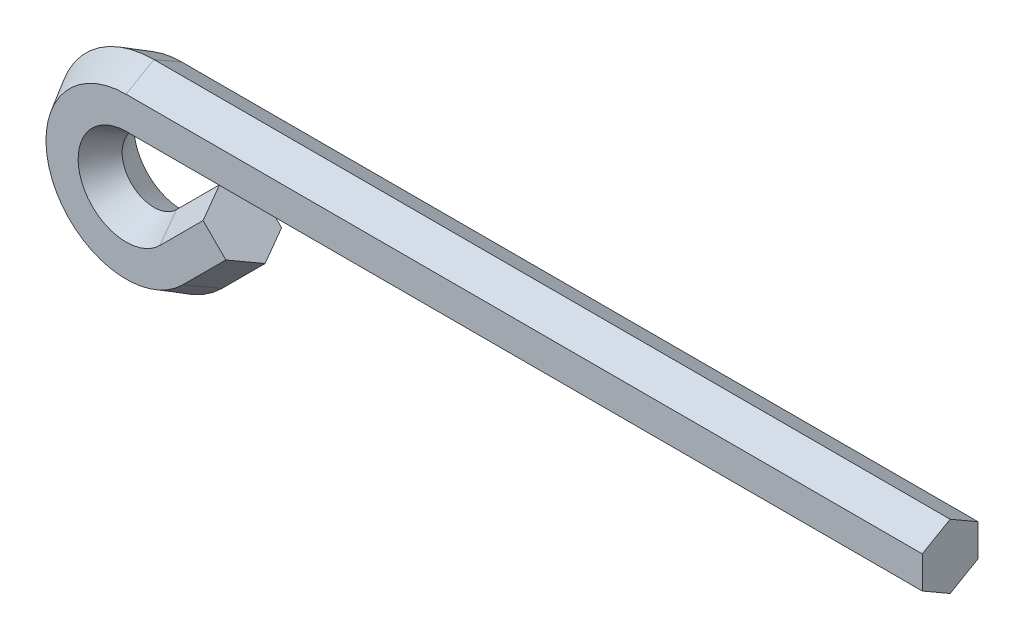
from build123d import *


with BuildPart() as part:
    # Base-Sweep: sweep along a path in Sketch1
    with BuildLine(Plane.XY) as base_sweep_path:
        Line((100, 4), (0, 4))
        ThreePointArc((0, 4), (-3.69551813, -1.530733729), (2.828427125, -2.828427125))
        Line((2.828427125, -2.828427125), (8.242640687, 2.585786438))
    # Sketch2 → Base-Sweep (sweep)
    with BuildSketch(Plane(origin=(100, 4, 0), x_dir=(0, 0, 1), z_dir=(-1, 0, 0))):
        Polygon((-3.5, 6.062177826), (0, 8.082903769), (3.5, 6.062177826), (3.5, 2.020725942), (0, 0), (-3.5, 2.020725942), align=None)
    sweep(path=base_sweep_path.line)


solid = part.part
